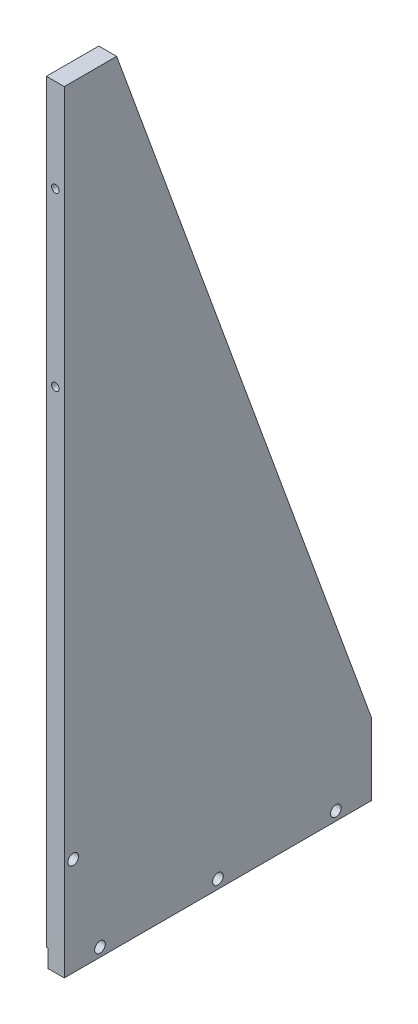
ISO-10303-21;
HEADER;
FILE_DESCRIPTION(('STEP AP214'),'2;1');
FILE_NAME('part.step','',(''),(''),'','','');
FILE_SCHEMA(('AUTOMOTIVE_DESIGN { 1 0 10303 214 1 1 1 1 }'));
ENDSEC;
DATA;
#1=APPLICATION_CONTEXT('core data for automotive mechanical design processes');
#2=APPLICATION_PROTOCOL_DEFINITION('international standard','automotive_design',2000,#1);
#3=PRODUCT_CONTEXT('',#1,'mechanical');
#4=PRODUCT('Part','Part','',(#3));
#5=PRODUCT_RELATED_PRODUCT_CATEGORY('part','',(#4));
#6=PRODUCT_DEFINITION_FORMATION('','',#4);
#7=PRODUCT_DEFINITION_CONTEXT('part definition',#1,'design');
#8=PRODUCT_DEFINITION('design','',#6,#7);
#9=PRODUCT_DEFINITION_SHAPE('','',#8);
#10=(LENGTH_UNIT() NAMED_UNIT(*) SI_UNIT(.MILLI.,.METRE.));
#11=(NAMED_UNIT(*) PLANE_ANGLE_UNIT() SI_UNIT($,.RADIAN.));
#12=(NAMED_UNIT(*) SI_UNIT($,.STERADIAN.) SOLID_ANGLE_UNIT());
#13=UNCERTAINTY_MEASURE_WITH_UNIT(LENGTH_MEASURE(1.E-05),#10,'distance_accuracy_value','');
#14=(GEOMETRIC_REPRESENTATION_CONTEXT(3) GLOBAL_UNCERTAINTY_ASSIGNED_CONTEXT((#13)) GLOBAL_UNIT_ASSIGNED_CONTEXT((#10,
#11,#12)) REPRESENTATION_CONTEXT('',''));
#15=CARTESIAN_POINT('',(0.,0.,0.));
#16=DIRECTION('',(0.,0.,1.));
#17=DIRECTION('',(1.,0.,0.));
#18=AXIS2_PLACEMENT_3D('',#15,#16,#17);
#19=CARTESIAN_POINT('',(6.35,0.,0.));
#20=DIRECTION('',(0.,1.,0.));
#21=DIRECTION('',(0.,0.,1.));
#22=AXIS2_PLACEMENT_3D('',#19,#20,#21);
#23=PLANE('',#22);
#24=DIRECTION('',(0.,0.,1.));
#25=VECTOR('',#24,1.);
#26=CARTESIAN_POINT('',(0.635,0.,0.));
#27=LINE('',#26,#25);
#28=CARTESIAN_POINT('',(0.635,0.,-109.22));
#29=VERTEX_POINT('',#28);
#30=CARTESIAN_POINT('',(0.635,0.,0.));
#31=VERTEX_POINT('',#30);
#32=EDGE_CURVE('E115',#29,#31,#27,.T.);
#33=ORIENTED_EDGE('',*,*,#32,.F.);
#34=DIRECTION('',(-1.,0.,0.));
#35=VECTOR('',#34,1.);
#36=CARTESIAN_POINT('',(6.35,0.,-109.22));
#37=LINE('',#36,#35);
#38=CARTESIAN_POINT('',(6.35,0.,-109.22));
#39=VERTEX_POINT('',#38);
#40=EDGE_CURVE('E112',#39,#29,#37,.T.);
#41=ORIENTED_EDGE('',*,*,#40,.F.);
#42=DIRECTION('',(0.,0.,-1.));
#43=VECTOR('',#42,1.);
#44=CARTESIAN_POINT('',(6.35,0.,0.));
#45=LINE('',#44,#43);
#46=CARTESIAN_POINT('',(6.35,0.,0.));
#47=VERTEX_POINT('',#46);
#48=EDGE_CURVE('E101',#47,#39,#45,.T.);
#49=ORIENTED_EDGE('',*,*,#48,.F.);
#50=DIRECTION('',(-1.,0.,0.));
#51=VECTOR('',#50,1.);
#52=CARTESIAN_POINT('',(6.35,0.,0.));
#53=LINE('',#52,#51);
#54=EDGE_CURVE('E52',#47,#31,#53,.T.);
#55=ORIENTED_EDGE('',*,*,#54,.T.);
#56=EDGE_LOOP('',(#33,#41,#49,#55));
#57=FACE_BOUND('',#56,.T.);
#58=ADVANCED_FACE('F43',(#57),#23,.F.);
#59=CARTESIAN_POINT('',(6.35,274.32,-18.6205292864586));
#60=DIRECTION('',(0.,-1.,0.));
#61=DIRECTION('',(0.,0.,-1.));
#62=AXIS2_PLACEMENT_3D('',#59,#60,#61);
#63=PLANE('',#62);
#64=DIRECTION('',(0.,0.,1.));
#65=VECTOR('',#64,1.);
#66=CARTESIAN_POINT('',(0.,274.32,-18.6205292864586));
#67=LINE('',#66,#65);
#68=CARTESIAN_POINT('',(0.,274.32,-18.6205292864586));
#69=VERTEX_POINT('',#68);
#70=CARTESIAN_POINT('',(0.,274.32,0.));
#71=VERTEX_POINT('',#70);
#72=EDGE_CURVE('E126',#69,#71,#67,.T.);
#73=ORIENTED_EDGE('',*,*,#72,.T.);
#74=DIRECTION('',(-1.,0.,0.));
#75=VECTOR('',#74,1.);
#76=CARTESIAN_POINT('',(6.35,274.32,0.));
#77=LINE('',#76,#75);
#78=CARTESIAN_POINT('',(6.35,274.32,0.));
#79=VERTEX_POINT('',#78);
#80=EDGE_CURVE('E11',#79,#71,#77,.T.);
#81=ORIENTED_EDGE('',*,*,#80,.F.);
#82=DIRECTION('',(0.,0.,1.));
#83=VECTOR('',#82,1.);
#84=CARTESIAN_POINT('',(6.35,274.32,-18.6205292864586));
#85=LINE('',#84,#83);
#86=CARTESIAN_POINT('',(6.35,274.32,-18.6205292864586));
#87=VERTEX_POINT('',#86);
#88=EDGE_CURVE('E136',#87,#79,#85,.T.);
#89=ORIENTED_EDGE('',*,*,#88,.F.);
#90=DIRECTION('',(-1.,0.,0.));
#91=VECTOR('',#90,1.);
#92=CARTESIAN_POINT('',(6.35,274.32,-18.6205292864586));
#93=LINE('',#92,#91);
#94=EDGE_CURVE('E122',#87,#69,#93,.T.);
#95=ORIENTED_EDGE('',*,*,#94,.T.);
#96=EDGE_LOOP('',(#73,#81,#89,#95));
#97=FACE_BOUND('',#96,.T.);
#98=ADVANCED_FACE('F45',(#97),#63,.F.);
#99=CARTESIAN_POINT('',(6.35,274.32,0.));
#100=DIRECTION('',(0.,0.,-1.));
#101=DIRECTION('',(0.,1.,0.));
#102=AXIS2_PLACEMENT_3D('',#99,#100,#101);
#103=PLANE('',#102);
#104=CARTESIAN_POINT('',(3.17499999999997,241.3,0.));
#105=DIRECTION('',(0.,0.,1.));
#106=DIRECTION('',(1.,0.,0.));
#107=AXIS2_PLACEMENT_3D('',#104,#105,#106);
#108=CIRCLE('',#107,1.35254999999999);
#109=CARTESIAN_POINT('',(4.52754999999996,241.3,0.));
#110=VERTEX_POINT('',#109);
#111=EDGE_CURVE('E174',#110,#110,#108,.T.);
#112=ORIENTED_EDGE('',*,*,#111,.F.);
#113=EDGE_LOOP('',(#112));
#114=FACE_BOUND('',#113,.T.);
#115=CARTESIAN_POINT('',(3.17499999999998,180.34,0.));
#116=DIRECTION('',(0.,0.,1.));
#117=DIRECTION('',(1.,0.,0.));
#118=AXIS2_PLACEMENT_3D('',#115,#116,#117);
#119=CIRCLE('',#118,1.35254999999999);
#120=CARTESIAN_POINT('',(4.52754999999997,180.34,0.));
#121=VERTEX_POINT('',#120);
#122=EDGE_CURVE('E181',#121,#121,#119,.T.);
#123=ORIENTED_EDGE('',*,*,#122,.F.);
#124=EDGE_LOOP('',(#123));
#125=FACE_BOUND('',#124,.T.);
#126=DIRECTION('',(0.,-1.,0.));
#127=VECTOR('',#126,1.);
#128=CARTESIAN_POINT('',(0.,274.32,0.));
#129=LINE('',#128,#127);
#130=CARTESIAN_POINT('',(0.,6.34999999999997,0.));
#131=VERTEX_POINT('',#130);
#132=EDGE_CURVE('E129',#71,#131,#129,.T.);
#133=ORIENTED_EDGE('',*,*,#132,.T.);
#134=DIRECTION('',(-1.,0.,0.));
#135=VECTOR('',#134,1.);
#136=CARTESIAN_POINT('',(0.635,6.35,0.));
#137=LINE('',#136,#135);
#138=CARTESIAN_POINT('',(0.635,6.35,0.));
#139=VERTEX_POINT('',#138);
#140=EDGE_CURVE('E60',#139,#131,#137,.T.);
#141=ORIENTED_EDGE('',*,*,#140,.F.);
#142=DIRECTION('',(0.,1.,0.));
#143=VECTOR('',#142,1.);
#144=CARTESIAN_POINT('',(0.635,0.,0.));
#145=LINE('',#144,#143);
#146=EDGE_CURVE('E160',#31,#139,#145,.T.);
#147=ORIENTED_EDGE('',*,*,#146,.F.);
#148=ORIENTED_EDGE('',*,*,#54,.F.);
#149=DIRECTION('',(0.,-1.,0.));
#150=VECTOR('',#149,1.);
#151=CARTESIAN_POINT('',(6.35,274.32,0.));
#152=LINE('',#151,#150);
#153=EDGE_CURVE('E95',#79,#47,#152,.T.);
#154=ORIENTED_EDGE('',*,*,#153,.F.);
#155=ORIENTED_EDGE('',*,*,#80,.T.);
#156=EDGE_LOOP('',(#133,#141,#147,#148,#154,#155));
#157=FACE_BOUND('',#156,.T.);
#158=ADVANCED_FACE('F190',(#114,#125,#157),#103,.F.);
#159=CARTESIAN_POINT('',(6.35,0.,-109.22));
#160=DIRECTION('',(0.,0.,1.));
#161=DIRECTION('',(1.,0.,0.));
#162=AXIS2_PLACEMENT_3D('',#159,#160,#161);
#163=PLANE('',#162);
#164=DIRECTION('',(0.,-1.,0.));
#165=VECTOR('',#164,1.);
#166=CARTESIAN_POINT('',(0.635,0.,-109.22));
#167=LINE('',#166,#165);
#168=CARTESIAN_POINT('',(0.635,6.34999999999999,-109.22));
#169=VERTEX_POINT('',#168);
#170=EDGE_CURVE('E166',#169,#29,#167,.T.);
#171=ORIENTED_EDGE('',*,*,#170,.F.);
#172=DIRECTION('',(-1.,0.,0.));
#173=VECTOR('',#172,1.);
#174=CARTESIAN_POINT('',(0.635,6.34999999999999,-109.22));
#175=LINE('',#174,#173);
#176=CARTESIAN_POINT('',(0.,6.34999999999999,-109.22));
#177=VERTEX_POINT('',#176);
#178=EDGE_CURVE('E171',#169,#177,#175,.T.);
#179=ORIENTED_EDGE('',*,*,#178,.T.);
#180=DIRECTION('',(0.,1.,0.));
#181=VECTOR('',#180,1.);
#182=CARTESIAN_POINT('',(0.,0.,-109.22));
#183=LINE('',#182,#181);
#184=CARTESIAN_POINT('',(0.,25.4,-109.22));
#185=VERTEX_POINT('',#184);
#186=EDGE_CURVE('E133',#177,#185,#183,.T.);
#187=ORIENTED_EDGE('',*,*,#186,.T.);
#188=DIRECTION('',(-1.,0.,0.));
#189=VECTOR('',#188,1.);
#190=CARTESIAN_POINT('',(6.35,25.4,-109.22));
#191=LINE('',#190,#189);
#192=CARTESIAN_POINT('',(6.35,25.4,-109.22));
#193=VERTEX_POINT('',#192);
#194=EDGE_CURVE('E118',#193,#185,#191,.T.);
#195=ORIENTED_EDGE('',*,*,#194,.F.);
#196=DIRECTION('',(0.,1.,0.));
#197=VECTOR('',#196,1.);
#198=CARTESIAN_POINT('',(6.35,0.,-109.22));
#199=LINE('',#198,#197);
#200=EDGE_CURVE('E105',#39,#193,#199,.T.);
#201=ORIENTED_EDGE('',*,*,#200,.F.);
#202=ORIENTED_EDGE('',*,*,#40,.T.);
#203=EDGE_LOOP('',(#171,#179,#187,#195,#201,#202));
#204=FACE_BOUND('',#203,.T.);
#205=ADVANCED_FACE('F120',(#204),#163,.F.);
#206=CARTESIAN_POINT('',(6.35,25.4,-109.22));
#207=DIRECTION('',(0.,-0.342020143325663,0.93969262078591));
#208=DIRECTION('',(0.,-0.93969262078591,-0.342020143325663));
#209=AXIS2_PLACEMENT_3D('',#206,#207,#208);
#210=PLANE('',#209);
#211=DIRECTION('',(0.,0.93969262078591,0.342020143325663));
#212=VECTOR('',#211,1.);
#213=CARTESIAN_POINT('',(0.,25.4,-109.22));
#214=LINE('',#213,#212);
#215=EDGE_CURVE('E87',#185,#69,#214,.T.);
#216=ORIENTED_EDGE('',*,*,#215,.T.);
#217=ORIENTED_EDGE('',*,*,#94,.F.);
#218=DIRECTION('',(0.,0.93969262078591,0.342020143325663));
#219=VECTOR('',#218,1.);
#220=CARTESIAN_POINT('',(6.35,25.4,-109.22));
#221=LINE('',#220,#219);
#222=EDGE_CURVE('E69',#193,#87,#221,.T.);
#223=ORIENTED_EDGE('',*,*,#222,.F.);
#224=ORIENTED_EDGE('',*,*,#194,.T.);
#225=EDGE_LOOP('',(#216,#217,#223,#224));
#226=FACE_BOUND('',#225,.T.);
#227=ADVANCED_FACE('F232',(#226),#210,.F.);
#228=CARTESIAN_POINT('',(6.35,0.,0.));
#229=DIRECTION('',(1.,0.,0.));
#230=DIRECTION('',(0.,0.,-1.));
#231=AXIS2_PLACEMENT_3D('',#228,#229,#230);
#232=PLANE('',#231);
#233=CARTESIAN_POINT('',(6.35,34.925,-3.17499999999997));
#234=DIRECTION('',(1.,0.,0.));
#235=DIRECTION('',(0.,0.,-1.));
#236=AXIS2_PLACEMENT_3D('',#233,#234,#235);
#237=CIRCLE('',#236,1.89864999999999);
#238=CARTESIAN_POINT('',(6.35,34.925,-5.07364999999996));
#239=VERTEX_POINT('',#238);
#240=EDGE_CURVE('E281',#239,#239,#237,.T.);
#241=ORIENTED_EDGE('',*,*,#240,.F.);
#242=EDGE_LOOP('',(#241));
#243=FACE_BOUND('',#242,.T.);
#244=CARTESIAN_POINT('',(6.35,3.17499999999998,-12.7));
#245=DIRECTION('',(1.,0.,0.));
#246=DIRECTION('',(0.,0.,-1.));
#247=AXIS2_PLACEMENT_3D('',#244,#245,#246);
#248=CIRCLE('',#247,1.89864999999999);
#249=CARTESIAN_POINT('',(6.35,3.17499999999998,-14.59865));
#250=VERTEX_POINT('',#249);
#251=EDGE_CURVE('E153',#250,#250,#248,.T.);
#252=ORIENTED_EDGE('',*,*,#251,.F.);
#253=EDGE_LOOP('',(#252));
#254=FACE_BOUND('',#253,.T.);
#255=CARTESIAN_POINT('',(6.35,3.175,-54.61));
#256=DIRECTION('',(1.,0.,0.));
#257=DIRECTION('',(0.,0.,-1.));
#258=AXIS2_PLACEMENT_3D('',#255,#256,#257);
#259=CIRCLE('',#258,1.89864999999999);
#260=CARTESIAN_POINT('',(6.35,3.175,-56.50865));
#261=VERTEX_POINT('',#260);
#262=EDGE_CURVE('E142',#261,#261,#259,.T.);
#263=ORIENTED_EDGE('',*,*,#262,.F.);
#264=EDGE_LOOP('',(#263));
#265=FACE_BOUND('',#264,.T.);
#266=CARTESIAN_POINT('',(6.35,3.175,-96.52));
#267=DIRECTION('',(1.,0.,0.));
#268=DIRECTION('',(0.,0.,-1.));
#269=AXIS2_PLACEMENT_3D('',#266,#267,#268);
#270=CIRCLE('',#269,1.89864999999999);
#271=CARTESIAN_POINT('',(6.35,3.175,-98.41865));
#272=VERTEX_POINT('',#271);
#273=EDGE_CURVE('E141',#272,#272,#270,.T.);
#274=ORIENTED_EDGE('',*,*,#273,.F.);
#275=EDGE_LOOP('',(#274));
#276=FACE_BOUND('',#275,.T.);
#277=ORIENTED_EDGE('',*,*,#88,.T.);
#278=ORIENTED_EDGE('',*,*,#153,.T.);
#279=ORIENTED_EDGE('',*,*,#48,.T.);
#280=ORIENTED_EDGE('',*,*,#200,.T.);
#281=ORIENTED_EDGE('',*,*,#222,.T.);
#282=EDGE_LOOP('',(#277,#278,#279,#280,#281));
#283=FACE_BOUND('',#282,.T.);
#284=ADVANCED_FACE('F103',(#243,#254,#265,#276,#283),#232,.T.);
#285=CARTESIAN_POINT('',(0.,0.,0.));
#286=DIRECTION('',(1.,0.,0.));
#287=DIRECTION('',(0.,0.,-1.));
#288=AXIS2_PLACEMENT_3D('',#285,#286,#287);
#289=PLANE('',#288);
#290=CARTESIAN_POINT('',(0.,34.925,-3.17499999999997));
#291=DIRECTION('',(1.,0.,0.));
#292=DIRECTION('',(0.,0.,-1.));
#293=AXIS2_PLACEMENT_3D('',#290,#291,#292);
#294=CIRCLE('',#293,1.89864999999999);
#295=CARTESIAN_POINT('',(0.,34.925,-5.07364999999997));
#296=VERTEX_POINT('',#295);
#297=EDGE_CURVE('E278',#296,#296,#294,.T.);
#298=ORIENTED_EDGE('',*,*,#297,.T.);
#299=EDGE_LOOP('',(#298));
#300=FACE_BOUND('',#299,.T.);
#301=ORIENTED_EDGE('',*,*,#186,.F.);
#302=DIRECTION('',(0.,0.,-1.));
#303=VECTOR('',#302,1.);
#304=CARTESIAN_POINT('',(0.,6.35,0.));
#305=LINE('',#304,#303);
#306=EDGE_CURVE('E159',#131,#177,#305,.T.);
#307=ORIENTED_EDGE('',*,*,#306,.F.);
#308=ORIENTED_EDGE('',*,*,#132,.F.);
#309=ORIENTED_EDGE('',*,*,#72,.F.);
#310=ORIENTED_EDGE('',*,*,#215,.F.);
#311=EDGE_LOOP('',(#301,#307,#308,#309,#310));
#312=FACE_BOUND('',#311,.T.);
#313=ADVANCED_FACE('F195',(#300,#312),#289,.F.);
#314=CARTESIAN_POINT('',(3.17499999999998,180.34,-10.9728));
#315=DIRECTION('',(0.,0.,1.));
#316=DIRECTION('',(1.,0.,0.));
#317=AXIS2_PLACEMENT_3D('',#314,#315,#316);
#318=CONICAL_SURFACE('',#317,1.35254999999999,1.02974425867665);
#319=CARTESIAN_POINT('',(3.17499999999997,180.34,-11.7854940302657));
#320=VERTEX_POINT('',#319);
#321=VERTEX_LOOP('',#320);
#322=FACE_BOUND('',#321,.T.);
#323=CARTESIAN_POINT('',(3.17499999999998,180.34,-10.9728));
#324=DIRECTION('',(0.,0.,1.));
#325=DIRECTION('',(1.,0.,0.));
#326=AXIS2_PLACEMENT_3D('',#323,#324,#325);
#327=CIRCLE('',#326,1.35254999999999);
#328=CARTESIAN_POINT('',(4.52754999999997,180.34,-10.9728));
#329=VERTEX_POINT('',#328);
#330=EDGE_CURVE('E130',#329,#329,#327,.T.);
#331=ORIENTED_EDGE('',*,*,#330,.T.);
#332=EDGE_LOOP('',(#331));
#333=FACE_BOUND('',#332,.T.);
#334=ADVANCED_FACE('F213',(#322,#333),#318,.F.);
#335=CARTESIAN_POINT('',(3.17499999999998,180.34,0.));
#336=DIRECTION('',(0.,0.,1.));
#337=DIRECTION('',(1.,0.,0.));
#338=AXIS2_PLACEMENT_3D('',#335,#336,#337);
#339=CYLINDRICAL_SURFACE('',#338,1.35254999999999);
#340=ORIENTED_EDGE('',*,*,#330,.F.);
#341=EDGE_LOOP('',(#340));
#342=FACE_BOUND('',#341,.T.);
#343=ORIENTED_EDGE('',*,*,#122,.T.);
#344=EDGE_LOOP('',(#343));
#345=FACE_BOUND('',#344,.T.);
#346=ADVANCED_FACE('F216',(#342,#345),#339,.F.);
#347=CARTESIAN_POINT('',(3.17499999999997,241.3,-10.9728));
#348=DIRECTION('',(0.,0.,1.));
#349=DIRECTION('',(1.,0.,0.));
#350=AXIS2_PLACEMENT_3D('',#347,#348,#349);
#351=CONICAL_SURFACE('',#350,1.35254999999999,1.02974425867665);
#352=CARTESIAN_POINT('',(3.17499999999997,241.3,-11.7854940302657));
#353=VERTEX_POINT('',#352);
#354=VERTEX_LOOP('',#353);
#355=FACE_BOUND('',#354,.T.);
#356=CARTESIAN_POINT('',(3.17499999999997,241.3,-10.9728));
#357=DIRECTION('',(0.,0.,1.));
#358=DIRECTION('',(1.,0.,0.));
#359=AXIS2_PLACEMENT_3D('',#356,#357,#358);
#360=CIRCLE('',#359,1.35254999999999);
#361=CARTESIAN_POINT('',(4.52754999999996,241.3,-10.9728));
#362=VERTEX_POINT('',#361);
#363=EDGE_CURVE('E178',#362,#362,#360,.T.);
#364=ORIENTED_EDGE('',*,*,#363,.T.);
#365=EDGE_LOOP('',(#364));
#366=FACE_BOUND('',#365,.T.);
#367=ADVANCED_FACE('F222',(#355,#366),#351,.F.);
#368=CARTESIAN_POINT('',(3.17499999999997,241.3,0.));
#369=DIRECTION('',(0.,0.,1.));
#370=DIRECTION('',(1.,0.,0.));
#371=AXIS2_PLACEMENT_3D('',#368,#369,#370);
#372=CYLINDRICAL_SURFACE('',#371,1.35254999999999);
#373=ORIENTED_EDGE('',*,*,#363,.F.);
#374=EDGE_LOOP('',(#373));
#375=FACE_BOUND('',#374,.T.);
#376=ORIENTED_EDGE('',*,*,#111,.T.);
#377=EDGE_LOOP('',(#376));
#378=FACE_BOUND('',#377,.T.);
#379=ADVANCED_FACE('F250',(#375,#378),#372,.F.);
#380=CARTESIAN_POINT('',(0.635,6.35,0.));
#381=DIRECTION('',(0.,1.,0.));
#382=DIRECTION('',(0.,0.,1.));
#383=AXIS2_PLACEMENT_3D('',#380,#381,#382);
#384=PLANE('',#383);
#385=ORIENTED_EDGE('',*,*,#306,.T.);
#386=ORIENTED_EDGE('',*,*,#178,.F.);
#387=DIRECTION('',(0.,0.,-1.));
#388=VECTOR('',#387,1.);
#389=CARTESIAN_POINT('',(0.635,6.35,0.));
#390=LINE('',#389,#388);
#391=EDGE_CURVE('E163',#139,#169,#390,.T.);
#392=ORIENTED_EDGE('',*,*,#391,.F.);
#393=ORIENTED_EDGE('',*,*,#140,.T.);
#394=EDGE_LOOP('',(#385,#386,#392,#393));
#395=FACE_BOUND('',#394,.T.);
#396=ADVANCED_FACE('F198',(#395),#384,.F.);
#397=CARTESIAN_POINT('',(0.635,0.,0.));
#398=DIRECTION('',(-1.,0.,0.));
#399=DIRECTION('',(0.,0.,1.));
#400=AXIS2_PLACEMENT_3D('',#397,#398,#399);
#401=PLANE('',#400);
#402=CARTESIAN_POINT('',(0.635,3.17499999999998,-12.7));
#403=DIRECTION('',(-1.,0.,0.));
#404=DIRECTION('',(0.,0.,1.));
#405=AXIS2_PLACEMENT_3D('',#402,#403,#404);
#406=CIRCLE('',#405,1.89864999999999);
#407=CARTESIAN_POINT('',(0.635,3.17499999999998,-10.80135));
#408=VERTEX_POINT('',#407);
#409=EDGE_CURVE('E47',#408,#408,#406,.T.);
#410=ORIENTED_EDGE('',*,*,#409,.F.);
#411=EDGE_LOOP('',(#410));
#412=FACE_BOUND('',#411,.T.);
#413=CARTESIAN_POINT('',(0.635,3.175,-54.61));
#414=DIRECTION('',(-1.,0.,0.));
#415=DIRECTION('',(0.,0.,1.));
#416=AXIS2_PLACEMENT_3D('',#413,#414,#415);
#417=CIRCLE('',#416,1.89864999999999);
#418=CARTESIAN_POINT('',(0.635,3.175,-52.71135));
#419=VERTEX_POINT('',#418);
#420=EDGE_CURVE('E139',#419,#419,#417,.T.);
#421=ORIENTED_EDGE('',*,*,#420,.F.);
#422=EDGE_LOOP('',(#421));
#423=FACE_BOUND('',#422,.T.);
#424=CARTESIAN_POINT('',(0.635,3.175,-96.52));
#425=DIRECTION('',(-1.,0.,0.));
#426=DIRECTION('',(0.,0.,1.));
#427=AXIS2_PLACEMENT_3D('',#424,#425,#426);
#428=CIRCLE('',#427,1.89864999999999);
#429=CARTESIAN_POINT('',(0.635,3.175,-94.62135));
#430=VERTEX_POINT('',#429);
#431=EDGE_CURVE('E146',#430,#430,#428,.T.);
#432=ORIENTED_EDGE('',*,*,#431,.F.);
#433=EDGE_LOOP('',(#432));
#434=FACE_BOUND('',#433,.T.);
#435=ORIENTED_EDGE('',*,*,#146,.T.);
#436=ORIENTED_EDGE('',*,*,#391,.T.);
#437=ORIENTED_EDGE('',*,*,#170,.T.);
#438=ORIENTED_EDGE('',*,*,#32,.T.);
#439=EDGE_LOOP('',(#435,#436,#437,#438));
#440=FACE_BOUND('',#439,.T.);
#441=ADVANCED_FACE('F203',(#412,#423,#434,#440),#401,.T.);
#442=CARTESIAN_POINT('',(6.35,3.175,-96.52));
#443=DIRECTION('',(1.,0.,0.));
#444=DIRECTION('',(0.,0.,-1.));
#445=AXIS2_PLACEMENT_3D('',#442,#443,#444);
#446=CYLINDRICAL_SURFACE('',#445,1.89864999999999);
#447=ORIENTED_EDGE('',*,*,#431,.T.);
#448=EDGE_LOOP('',(#447));
#449=FACE_BOUND('',#448,.T.);
#450=ORIENTED_EDGE('',*,*,#273,.T.);
#451=EDGE_LOOP('',(#450));
#452=FACE_BOUND('',#451,.T.);
#453=ADVANCED_FACE('F258',(#449,#452),#446,.F.);
#454=CARTESIAN_POINT('',(6.35,3.175,-54.61));
#455=DIRECTION('',(1.,0.,0.));
#456=DIRECTION('',(0.,0.,-1.));
#457=AXIS2_PLACEMENT_3D('',#454,#455,#456);
#458=CYLINDRICAL_SURFACE('',#457,1.89864999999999);
#459=ORIENTED_EDGE('',*,*,#420,.T.);
#460=EDGE_LOOP('',(#459));
#461=FACE_BOUND('',#460,.T.);
#462=ORIENTED_EDGE('',*,*,#262,.T.);
#463=EDGE_LOOP('',(#462));
#464=FACE_BOUND('',#463,.T.);
#465=ADVANCED_FACE('F262',(#461,#464),#458,.F.);
#466=CARTESIAN_POINT('',(6.35,3.17499999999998,-12.7));
#467=DIRECTION('',(1.,0.,0.));
#468=DIRECTION('',(0.,0.,-1.));
#469=AXIS2_PLACEMENT_3D('',#466,#467,#468);
#470=CYLINDRICAL_SURFACE('',#469,1.89864999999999);
#471=ORIENTED_EDGE('',*,*,#409,.T.);
#472=EDGE_LOOP('',(#471));
#473=FACE_BOUND('',#472,.T.);
#474=ORIENTED_EDGE('',*,*,#251,.T.);
#475=EDGE_LOOP('',(#474));
#476=FACE_BOUND('',#475,.T.);
#477=ADVANCED_FACE('F266',(#473,#476),#470,.F.);
#478=CARTESIAN_POINT('',(6.35,34.925,-3.17499999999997));
#479=DIRECTION('',(1.,0.,0.));
#480=DIRECTION('',(0.,0.,-1.));
#481=AXIS2_PLACEMENT_3D('',#478,#479,#480);
#482=CYLINDRICAL_SURFACE('',#481,1.89864999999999);
#483=ORIENTED_EDGE('',*,*,#297,.F.);
#484=EDGE_LOOP('',(#483));
#485=FACE_BOUND('',#484,.T.);
#486=ORIENTED_EDGE('',*,*,#240,.T.);
#487=EDGE_LOOP('',(#486));
#488=FACE_BOUND('',#487,.T.);
#489=ADVANCED_FACE('F269',(#485,#488),#482,.F.);
#490=CLOSED_SHELL('',(#58,#98,#158,#205,#227,#284,#313,#334,#346,#367,#379,#396,#441,#453,#465,
#477,#489));
#491=MANIFOLD_SOLID_BREP('B2',#490);
#492=ADVANCED_BREP_SHAPE_REPRESENTATION('',(#18,#491),#14);
#493=SHAPE_DEFINITION_REPRESENTATION(#9,#492);
ENDSEC;
END-ISO-10303-21;
